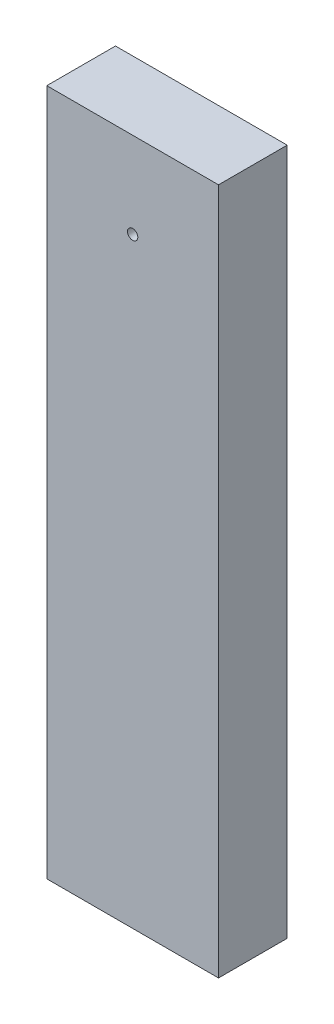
from build123d import *

# Parameters (mm, degrees)
ESQUISSE1_W             = 25
ESQUISSE1_H             = 100
BOSS_EXTRU_1_DEPTH      = 10
ESQUISSE2_R             = 0.75
ENL_V_MAT_EXTRU_1_DEPTH = 10
ESQUISSE3_R             = 0.75
ENL_V_MAT_EXTRU_2_DEPTH = 5


with BuildPart() as part:
    # Esquisse1 → Boss.-Extru.1 (new body)
    with BuildSketch(Plane.XY):
        with Locations((12.5, 50)):
            Rectangle(ESQUISSE1_W, ESQUISSE1_H)
    extrude(amount=BOSS_EXTRU_1_DEPTH)

    # Esquisse2 → Enl_v. mat.-Extru.1 (cut)
    with BuildSketch(Plane.XZ):
        with Locations(Location((12.5, 5, 0), (0, 0, 270))):
            Circle(ESQUISSE2_R)
    extrude(amount=-ENL_V_MAT_EXTRU_1_DEPTH, mode=Mode.SUBTRACT)

    # Esquisse3 → Enl_v. mat.-Extru.2 (cut)
    with BuildSketch(Plane.XY.offset(10)):
        with Locations((12.5, 87.5)):
            Circle(ESQUISSE3_R)
    extrude(amount=-ENL_V_MAT_EXTRU_2_DEPTH, mode=Mode.SUBTRACT)


solid = part.part
